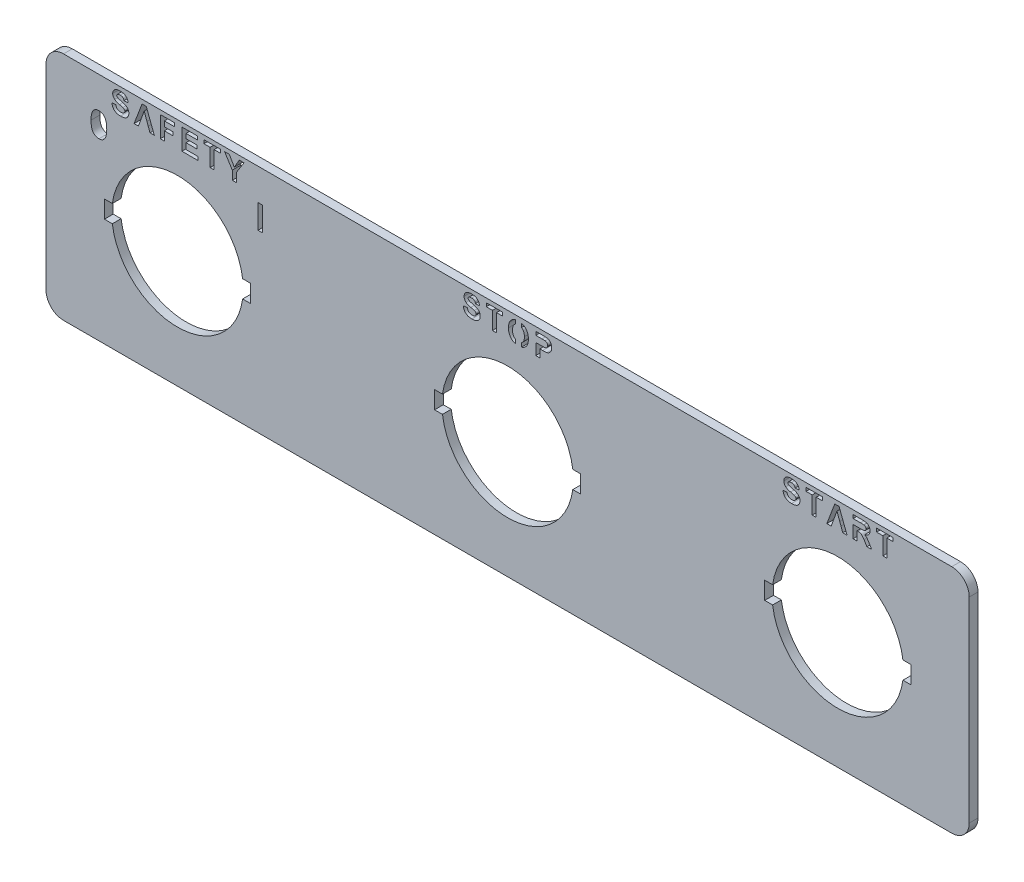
from build123d import *

# Parameters (mm, degrees)
AUFSATZ_LINEAR_AUSTRAGEN1_DEPTH = 1.5
SKIZZE4_W                       = 0.790251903
SKIZZE4_H                       = 4.109309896
SCHNITT_LINEAR_AUSTRAGEN1_DEPTH = 137.976275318
SCHNITT_LINEAR_AUSTRAGEN2_DEPTH = 10
SKIZZE5_W                       = 0.691470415
SKIZZE5_H                       = 1.060254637
SKIZZE5_H_2                     = 0.875862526
AUFSATZ_LINEAR_AUSTRAGEN3_DEPTH = 1.5


with BuildPart() as part:
    # Skizze3 → Aufsatz-Linear austragen1 (new body)
    with BuildSketch(Plane.XY):
        with BuildLine():
            Line((132.5, 19.5), (-19.5, 19.5))
            ThreePointArc((-19.5, 19.5), (-21.621320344, 18.621320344), (-22.5, 16.5))
            Line((-22.5, 16.5), (-22.5, -17))
            ThreePointArc((-22.5, -17), (-21.621320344, -19.121320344), (-19.5, -20))
            Line((-19.5, -20), (132.5, -20))
            ThreePointArc((132.5, -20), (134.621320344, -19.121320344), (135.5, -17))
            Line((135.5, -17), (135.5, 16.5))
            ThreePointArc((135.5, 16.5), (134.621320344, 18.621320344), (132.5, 19.5))
        make_face()
        with BuildLine():
            Line((11.14955156, 1.5), (12.5, 1.5))
            Line((12.5, 1.5), (12.5, -1.5))
            Line((12.5, -1.5), (11.14955156, -1.5))
            ThreePointArc((11.14955156, -1.5), (0, -11.25), (-11.14955156, -1.5))
            Line((-11.14955156, -1.5), (-12.5, -1.5))
            Line((-12.5, -1.5), (-12.5, 1.5))
            Line((-12.5, 1.5), (-11.14955156, 1.5))
            ThreePointArc((-11.14955156, 1.5), (0, 11.25), (11.14955156, 1.5))
        make_face(mode=Mode.SUBTRACT)
        with BuildLine():
            Line((67.64955156, 1.5), (69, 1.5))
            Line((69, 1.5), (69, -1.5))
            Line((69, -1.5), (67.64955156, -1.5))
            ThreePointArc((67.64955156, -1.5), (56.5, -11.25), (45.35044844, -1.5))
            Line((45.35044844, -1.5), (44, -1.5))
            Line((44, -1.5), (44, 1.5))
            Line((44, 1.5), (45.35044844, 1.5))
            ThreePointArc((45.35044844, 1.5), (56.5, 11.25), (67.64955156, 1.5))
        make_face(mode=Mode.SUBTRACT)
        with BuildLine():
            Line((124.14955156, 1.5), (125.5, 1.5))
            Line((125.5, 1.5), (125.5, -1.5))
            Line((125.5, -1.5), (124.14955156, -1.5))
            ThreePointArc((124.14955156, -1.5), (113, -11.25), (101.85044844, -1.5))
            Line((101.85044844, -1.5), (100.5, -1.5))
            Line((100.5, -1.5), (100.5, 1.5))
            Line((100.5, 1.5), (101.85044844, 1.5))
            ThreePointArc((101.85044844, 1.5), (113, 11.25), (124.14955156, 1.5))
        make_face(mode=Mode.SUBTRACT)
    extrude(amount=AUFSATZ_LINEAR_AUSTRAGEN1_DEPTH)

    # Skizze4 → Schnitt-Linear austragen1 (cut, through all)
    # profile 1 of 17: a face of its own
    with BuildSketch(Plane.XY):
        with BuildLine():
            Line((-11.224869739, 16.39854872), (-10.533399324, 16.444646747))
            add(Edge.make_bspline(
                [(-10.533399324, 16.444646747), (-10.527890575, 16.41571806), (-10.517190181, 16.359525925), (-10.493415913, 16.279444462), (-10.467247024, 16.204785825), (-10.435973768, 16.136350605), (-10.40173754, 16.072873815), (-10.361725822, 16.016163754), (-10.318729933, 15.964409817), (-10.270621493, 15.919470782), (-10.218207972, 15.880112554), (-10.161227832, 15.846546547), (-10.100298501, 15.817494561), (-10.035271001, 15.793571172), (-9.965475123, 15.775712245), (-9.891518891, 15.763006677), (-9.81329624, 15.754870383), (-9.759837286, 15.753750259), (-9.732446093, 15.753176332)],
                knots=[0, 0, 0, 0, 1.204560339, 2.339781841, 3.415289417, 4.440034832, 5.416475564, 6.362424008, 7.275913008, 8.16578645, 9.05021719, 9.95355393, 10.867835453, 11.809845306, 12.784702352, 13.812224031, 14.87903166, 16, 16, 16, 16], degree=3))
            add(Edge.make_bspline(
                [(-9.732446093, 15.753176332), (-9.70361513, 15.753490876), (-9.647537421, 15.75410268), (-9.566274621, 15.76169265), (-9.490290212, 15.772566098), (-9.420255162, 15.789778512), (-9.354861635, 15.809027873), (-9.295733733, 15.835363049), (-9.241914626, 15.865736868), (-9.193542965, 15.900203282), (-9.151328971, 15.938429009), (-9.114398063, 15.978335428), (-9.082233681, 16.019060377), (-9.056918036, 16.062411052), (-9.036430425, 16.106634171), (-9.022889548, 16.153048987), (-9.013741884, 16.200589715), (-9.012692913, 16.233080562), (-9.012164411, 16.249450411)],
                knots=[0, 0, 0, 0, 1.417779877, 2.757654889, 4.012140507, 5.189587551, 6.302846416, 7.360586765, 8.365575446, 9.33904572, 10.275781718, 11.161696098, 12.012180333, 12.822428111, 13.625933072, 14.403138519, 15.195454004, 16, 16, 16, 16], degree=3))
            add(Edge.make_bspline(
                [(-9.012164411, 16.249450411), (-9.012812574, 16.269960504), (-9.014080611, 16.310085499), (-9.029346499, 16.367448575), (-9.052240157, 16.420593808), (-9.086710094, 16.468736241), (-9.133046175, 16.512731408), (-9.192152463, 16.553887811), (-9.265678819, 16.590912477), (-9.320225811, 16.611564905), (-9.349256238, 16.622556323)],
                knots=[0, 0, 0, 0, 0.90494901, 1.770400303, 2.607161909, 3.452839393, 4.36912122, 5.420987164, 6.627424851, 8, 8, 8, 8], degree=3))
            add(Edge.make_bspline(
                [(-9.349256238, 16.622556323), (-9.361712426, 16.626730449), (-9.389587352, 16.636071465), (-9.437139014, 16.649428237), (-9.494416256, 16.666107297), (-9.562246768, 16.685065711), (-9.640607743, 16.704455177), (-9.728623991, 16.7283408), (-9.827368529, 16.752108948), (-9.896450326, 16.769654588), (-9.932684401, 16.778857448)],
                knots=[0, 0, 0, 0, 0.521821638, 1.167752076, 1.961721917, 2.891982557, 3.96540661, 5.168436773, 6.514817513, 8, 8, 8, 8], degree=3))
            add(Edge.make_bspline(
                [(-9.932684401, 16.778857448), (-9.979871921, 16.79063907), (-10.070912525, 16.813369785), (-10.200757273, 16.853806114), (-10.320346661, 16.893981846), (-10.428529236, 16.937574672), (-10.526498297, 16.981630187), (-10.612669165, 17.029241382), (-10.688840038, 17.077935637), (-10.733226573, 17.114330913), (-10.754525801, 17.131795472)],
                knots=[0, 0, 0, 0, 1.293880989, 2.496331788, 3.617634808, 4.64976062, 5.598842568, 6.473791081, 7.267636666, 8, 8, 8, 8], degree=3))
            add(Edge.make_bspline(
                [(-10.754525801, 17.131795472), (-10.780939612, 17.15652661), (-10.83272633, 17.205014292), (-10.900895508, 17.284688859), (-10.958176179, 17.368852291), (-11.005324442, 17.456883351), (-11.041627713, 17.549288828), (-11.067359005, 17.645450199), (-11.084013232, 17.745618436), (-11.085712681, 17.813835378), (-11.086575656, 17.848475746)],
                knots=[0, 0, 0, 0, 1.064429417, 2.086912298, 3.078678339, 4.055528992, 5.020032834, 5.993708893, 6.981211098, 8, 8, 8, 8], degree=3))
            add(Edge.make_bspline(
                [(-11.086575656, 17.848475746), (-11.084895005, 17.89329997), (-11.081561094, 17.98221785), (-11.050986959, 18.112914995), (-11.00336081, 18.239027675), (-10.94812577, 18.339165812), (-10.895056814, 18.414920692), (-10.850986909, 18.4692817), (-10.802571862, 18.520158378), (-10.749148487, 18.566309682), (-10.692700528, 18.610438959), (-10.631040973, 18.649626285), (-10.565918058, 18.686538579), (-10.47167778, 18.730296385), (-10.343725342, 18.775896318), (-10.177252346, 18.814334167), (-9.995996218, 18.837440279), (-9.870330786, 18.84027491), (-9.805194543, 18.841744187)],
                knots=[0, 0, 0, 0, 1.180131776, 2.341029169, 3.518901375, 4.725685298, 5.343762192, 5.955650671, 6.568945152, 7.192346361, 7.815201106, 8.455999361, 9.116257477, 9.787318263, 11.192748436, 12.688084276, 14.283332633, 16, 16, 16, 16], degree=3))
            add(Edge.make_bspline(
                [(-9.805194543, 18.841744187), (-9.751860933, 18.841030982), (-9.648128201, 18.839643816), (-9.497755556, 18.825616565), (-9.357299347, 18.803784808), (-9.227252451, 18.772445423), (-9.107554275, 18.731037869), (-8.997740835, 18.681713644), (-8.897905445, 18.623153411), (-8.809263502, 18.555021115), (-8.730292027, 18.479909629), (-8.661402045, 18.397866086), (-8.602330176, 18.309926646), (-8.552695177, 18.216155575), (-8.513716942, 18.116070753), (-8.485088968, 18.009797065), (-8.466154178, 17.897584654), (-8.461408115, 17.820695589), (-8.458988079, 17.78148955)],
                knots=[0, 0, 0, 0, 1.325124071, 2.577337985, 3.749592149, 4.855247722, 5.896868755, 6.892903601, 7.842551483, 8.766257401, 9.665194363, 10.546067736, 11.423174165, 12.293291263, 13.177512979, 14.086532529, 15.024315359, 16, 16, 16, 16], degree=3))
            Line((-8.458988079, 17.78148955), (-9.150458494, 17.735391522))
            add(Edge.make_bspline(
                [(-9.150458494, 17.735391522), (-9.154447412, 17.75707418), (-9.162221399, 17.799331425), (-9.179124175, 17.859852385), (-9.198189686, 17.91582737), (-9.220504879, 17.967256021), (-9.247458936, 18.013217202), (-9.276792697, 18.055156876), (-9.309315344, 18.09251622), (-9.346103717, 18.124272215), (-9.385893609, 18.15316887), (-9.431240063, 18.176330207), (-9.480243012, 18.19781883), (-9.534766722, 18.213973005), (-9.593764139, 18.226787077), (-9.657269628, 18.236286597), (-9.725414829, 18.240924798), (-9.772296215, 18.241943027), (-9.796551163, 18.242469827)],
                knots=[0, 0, 0, 0, 1.151066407, 2.24330871, 3.278475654, 4.238599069, 5.165719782, 6.056502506, 6.909492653, 7.744782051, 8.590364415, 9.471203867, 10.39832458, 11.382154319, 12.435022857, 13.550631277, 14.73277401, 16, 16, 16, 16], degree=3))
            add(Edge.make_bspline(
                [(-9.796551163, 18.242469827), (-9.821769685, 18.242004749), (-9.870833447, 18.24109992), (-9.942332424, 18.235547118), (-10.00940383, 18.225297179), (-10.07237707, 18.211954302), (-10.131168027, 18.19380224), (-10.185652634, 18.171668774), (-10.236080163, 18.14561087), (-10.266828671, 18.125109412), (-10.282021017, 18.114979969)],
                knots=[0, 0, 0, 0, 1.186678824, 2.308736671, 3.37120409, 4.377216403, 5.334874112, 6.262130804, 7.141346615, 8, 8, 8, 8], degree=3))
            add(Edge.make_bspline(
                [(-10.282021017, 18.114979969), (-10.299407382, 18.101142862), (-10.333079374, 18.074344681), (-10.369317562, 18.021132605), (-10.391133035, 17.961031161), (-10.393758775, 17.918529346), (-10.395105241, 17.896734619)],
                knots=[0, 0, 0, 0, 1.037857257, 2.010007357, 2.979541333, 4, 4, 4, 4], degree=3))
            add(Edge.make_bspline(
                [(-10.395105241, 17.896734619), (-10.394004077, 17.876366), (-10.391834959, 17.836243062), (-10.369956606, 17.77924756), (-10.336310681, 17.726437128), (-10.304874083, 17.69774981), (-10.288503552, 17.682810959)],
                knots=[0, 0, 0, 0, 0.98538058, 1.941042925, 2.927803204, 4, 4, 4, 4], degree=3))
            add(Edge.make_bspline(
                [(-10.288503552, 17.682810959), (-10.275511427, 17.673114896), (-10.246479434, 17.651448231), (-10.193298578, 17.623907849), (-10.129107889, 17.594079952), (-10.052443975, 17.564919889), (-9.963816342, 17.535813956), (-9.863219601, 17.505423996), (-9.75059188, 17.474626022), (-9.628804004, 17.444799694), (-9.505155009, 17.415482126), (-9.38716018, 17.383429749), (-9.277441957, 17.352181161), (-9.176509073, 17.31942757), (-9.083841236, 17.287542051), (-8.999888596, 17.254793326), (-8.924074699, 17.222899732), (-8.835667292, 17.179043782), (-8.735466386, 17.119639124), (-8.630444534, 17.033284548), (-8.537566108, 16.936216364), (-8.472850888, 16.844687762), (-8.428394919, 16.765970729), (-8.399769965, 16.703224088), (-8.375007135, 16.63710495), (-8.354850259, 16.567540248), (-8.340241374, 16.494432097), (-8.328151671, 16.418339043), (-8.321974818, 16.338629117), (-8.321125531, 16.284272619), (-8.320693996, 16.256653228)],
                knots=[0, 0, 0, 0, 0.511875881, 1.143829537, 1.88775736, 2.750598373, 3.734912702, 4.837306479, 6.073130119, 7.42648979, 8.801963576, 10.091065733, 11.292408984, 12.408830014, 13.446061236, 14.39066453, 15.257936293, 16.045629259, 17.510392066, 18.929669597, 20.331293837, 21.746891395, 22.460690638, 23.187651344, 23.925159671, 24.69163991, 25.474819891, 26.281170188, 27.126635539, 28, 28, 28, 28], degree=3))
            add(Edge.make_bspline(
                [(-8.320693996, 16.256653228), (-8.321287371, 16.231181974), (-8.322465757, 16.180598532), (-8.330700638, 16.105519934), (-8.343435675, 16.031774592), (-8.362287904, 15.959270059), (-8.38729731, 15.888148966), (-8.415455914, 15.81738484), (-8.450666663, 15.748520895), (-8.490741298, 15.681500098), (-8.534945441, 15.616372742), (-8.585036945, 15.556294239), (-8.638073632, 15.499260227), (-8.697444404, 15.448464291), (-8.759482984, 15.399793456), (-8.82702695, 15.356689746), (-8.898493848, 15.317684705), (-8.974335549, 15.283069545), (-9.054820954, 15.252905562), (-9.13984553, 15.226057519), (-9.230175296, 15.204084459), (-9.325057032, 15.185250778), (-9.424837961, 15.170928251), (-9.529393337, 15.160927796), (-9.638746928, 15.155288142), (-9.713232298, 15.15436977), (-9.751173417, 15.153901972)],
                knots=[0, 0, 0, 0, 0.900570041, 1.788444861, 2.667795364, 3.545012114, 4.433698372, 5.332345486, 6.235991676, 7.164928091, 8.092777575, 9.015680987, 9.928493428, 10.842962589, 11.775229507, 12.714851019, 13.672254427, 14.652424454, 15.660007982, 16.709910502, 17.803296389, 18.945495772, 20.129342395, 21.366102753, 22.658353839, 24, 24, 24, 24], degree=3))
            add(Edge.make_bspline(
                [(-9.751173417, 15.153901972), (-9.80595454, 15.154796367), (-9.912614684, 15.156537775), (-10.067572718, 15.172124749), (-10.212913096, 15.195981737), (-10.348399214, 15.230606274), (-10.474196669, 15.275056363), (-10.590248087, 15.329809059), (-10.695992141, 15.395191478), (-10.792738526, 15.469617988), (-10.879198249, 15.554444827), (-10.956943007, 15.647914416), (-11.024923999, 15.75086843), (-11.083096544, 15.863145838), (-11.132931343, 15.984139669), (-11.174030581, 16.113905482), (-11.204976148, 16.253062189), (-11.218123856, 16.34921448), (-11.224869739, 16.39854872)],
                knots=[0, 0, 0, 0, 1.217954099, 2.371385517, 3.459848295, 4.490682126, 5.476952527, 6.422732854, 7.338496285, 8.236688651, 9.131557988, 10.026443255, 10.935708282, 11.869506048, 12.834296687, 13.842423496, 14.892981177, 16, 16, 16, 16], degree=3))
        make_face()
    # profile 2 of 17: a face of its own
    with BuildSketch(Plane.XY):
        Polygon((-3.969040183, 15.2), (-4.702286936, 15.2), (-5.005525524, 16.029764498), (-6.385585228, 16.029764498), (-6.688823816, 15.2), (-7.426392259, 15.2), (-6.067220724, 18.795646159), (-5.334694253, 18.795646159), align=None)
        Polygon((-5.225211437, 16.629038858), (-5.697716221, 17.919783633), (-6.168780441, 16.629038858), align=None, mode=Mode.SUBTRACT)
    # profile 3 of 17: a face of its own
    with BuildSketch(Plane.XY):
        Polygon((-2.936444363, 15.2), (-2.936444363, 18.795646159), (-0.493248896, 18.795646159), (-0.493248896, 18.196371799), (-2.244973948, 18.196371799), (-2.244973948, 17.320509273), (-0.723739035, 17.320509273), (-0.723739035, 16.721234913), (-2.244973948, 16.721234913), (-2.244973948, 15.2), align=None)
    # profile 4 of 17: a face of its own
    with BuildSketch(Plane.XY):
        Polygon((0.769837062, 15.2), (0.769837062, 18.795646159), (3.443522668, 18.795646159), (3.443522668, 18.196371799), (1.461307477, 18.196371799), (1.461307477, 17.412705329), (3.305228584, 17.412705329), (3.305228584, 16.813430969), (1.461307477, 16.813430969), (1.461307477, 15.79927436), (3.489620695, 15.79927436), (3.489620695, 15.2), align=None)
    # profile 5 of 17: a face of its own
    with BuildSketch(Plane.XY):
        Polygon((5.582471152, 15.2), (5.582471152, 18.196371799), (4.522216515, 18.196371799), (4.522216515, 18.795646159), (7.334196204, 18.795646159), (7.334196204, 18.196371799), (6.273941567, 18.196371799), (6.273941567, 15.2), align=None)
    # profile 6 of 17: a face of its own
    with BuildSketch(Plane.XY):
        Polygon((9.380948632, 15.2), (9.380948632, 16.713311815), (8.067154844, 18.795646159), (8.876031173, 18.795646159), (9.725963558, 17.314026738), (10.577336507, 18.795646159), (11.386212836, 18.795646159), (10.072419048, 16.708269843), (10.072419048, 15.2), align=None)
    # profile 7 of 17: a face of its own
    with BuildSketch(Plane.XY):
        with BuildLine():
            Line((48.912264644, 16.39854872), (49.603735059, 16.444646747))
            add(Edge.make_bspline(
                [(49.603735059, 16.444646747), (49.609243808, 16.41571806), (49.619944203, 16.359525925), (49.643718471, 16.279444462), (49.66988736, 16.204785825), (49.701160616, 16.136350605), (49.735396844, 16.072873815), (49.775408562, 16.016163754), (49.818404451, 15.964409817), (49.866512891, 15.919470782), (49.918926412, 15.880112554), (49.975906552, 15.846546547), (50.036835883, 15.817494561), (50.101863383, 15.793571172), (50.171659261, 15.775712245), (50.245615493, 15.763006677), (50.323838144, 15.754870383), (50.377297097, 15.753750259), (50.40468829, 15.753176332)],
                knots=[0, 0, 0, 0, 1.204560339, 2.339781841, 3.415289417, 4.440034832, 5.416475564, 6.362424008, 7.275913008, 8.16578645, 9.05021719, 9.95355393, 10.867835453, 11.809845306, 12.784702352, 13.812224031, 14.87903166, 16, 16, 16, 16], degree=3))
            add(Edge.make_bspline(
                [(50.40468829, 15.753176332), (50.433519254, 15.753490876), (50.489596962, 15.75410268), (50.570859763, 15.76169265), (50.646844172, 15.772566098), (50.716879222, 15.789778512), (50.782272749, 15.809027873), (50.841400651, 15.835363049), (50.895219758, 15.865736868), (50.943591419, 15.900203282), (50.985805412, 15.938429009), (51.022736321, 15.978335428), (51.054900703, 16.019060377), (51.080216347, 16.062411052), (51.100703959, 16.106634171), (51.114244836, 16.153048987), (51.1233925, 16.200589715), (51.12444147, 16.233080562), (51.124969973, 16.249450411)],
                knots=[0, 0, 0, 0, 1.417779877, 2.757654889, 4.012140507, 5.189587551, 6.302846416, 7.360586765, 8.365575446, 9.33904572, 10.275781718, 11.161696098, 12.012180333, 12.822428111, 13.625933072, 14.403138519, 15.195454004, 16, 16, 16, 16], degree=3))
            add(Edge.make_bspline(
                [(51.124969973, 16.249450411), (51.12432181, 16.269960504), (51.123053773, 16.310085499), (51.107787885, 16.367448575), (51.084894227, 16.420593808), (51.050424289, 16.468736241), (51.004088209, 16.512731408), (50.944981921, 16.553887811), (50.871455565, 16.590912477), (50.816908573, 16.611564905), (50.787878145, 16.622556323)],
                knots=[0, 0, 0, 0, 0.90494901, 1.770400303, 2.607161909, 3.452839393, 4.36912122, 5.420987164, 6.627424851, 8, 8, 8, 8], degree=3))
            add(Edge.make_bspline(
                [(50.787878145, 16.622556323), (50.775421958, 16.626730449), (50.747547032, 16.636071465), (50.699995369, 16.649428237), (50.642718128, 16.666107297), (50.574887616, 16.685065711), (50.496526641, 16.704455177), (50.408510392, 16.7283408), (50.309765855, 16.752108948), (50.240684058, 16.769654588), (50.204449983, 16.778857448)],
                knots=[0, 0, 0, 0, 0.521821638, 1.167752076, 1.961721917, 2.891982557, 3.96540661, 5.168436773, 6.514817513, 8, 8, 8, 8], degree=3))
            add(Edge.make_bspline(
                [(50.204449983, 16.778857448), (50.157262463, 16.79063907), (50.066221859, 16.813369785), (49.936377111, 16.853806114), (49.816787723, 16.893981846), (49.708605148, 16.937574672), (49.610636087, 16.981630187), (49.524465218, 17.029241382), (49.448294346, 17.077935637), (49.40390781, 17.114330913), (49.382608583, 17.131795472)],
                knots=[0, 0, 0, 0, 1.293880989, 2.496331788, 3.617634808, 4.64976062, 5.598842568, 6.473791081, 7.267636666, 8, 8, 8, 8], degree=3))
            add(Edge.make_bspline(
                [(49.382608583, 17.131795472), (49.356194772, 17.15652661), (49.304408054, 17.205014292), (49.236238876, 17.284688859), (49.178958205, 17.368852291), (49.131809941, 17.456883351), (49.09550667, 17.549288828), (49.069775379, 17.645450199), (49.053121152, 17.745618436), (49.051421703, 17.813835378), (49.050558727, 17.848475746)],
                knots=[0, 0, 0, 0, 1.064429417, 2.086912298, 3.078678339, 4.055528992, 5.020032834, 5.993708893, 6.981211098, 8, 8, 8, 8], degree=3))
            add(Edge.make_bspline(
                [(49.050558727, 17.848475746), (49.052239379, 17.89329997), (49.05557329, 17.98221785), (49.086147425, 18.112914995), (49.133773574, 18.239027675), (49.189008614, 18.339165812), (49.24207757, 18.414920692), (49.286147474, 18.4692817), (49.334562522, 18.520158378), (49.387985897, 18.566309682), (49.444433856, 18.610438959), (49.50609341, 18.649626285), (49.571216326, 18.686538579), (49.665456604, 18.730296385), (49.793409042, 18.775896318), (49.959882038, 18.814334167), (50.141138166, 18.837440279), (50.266803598, 18.84027491), (50.33193984, 18.841744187)],
                knots=[0, 0, 0, 0, 1.180131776, 2.341029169, 3.518901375, 4.725685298, 5.343762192, 5.955650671, 6.568945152, 7.192346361, 7.815201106, 8.455999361, 9.116257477, 9.787318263, 11.192748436, 12.688084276, 14.283332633, 16, 16, 16, 16], degree=3))
            add(Edge.make_bspline(
                [(50.33193984, 18.841744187), (50.385273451, 18.841030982), (50.489006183, 18.839643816), (50.639378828, 18.825616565), (50.779835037, 18.803784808), (50.909881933, 18.772445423), (51.029580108, 18.731037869), (51.139393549, 18.681713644), (51.239228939, 18.623153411), (51.327870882, 18.555021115), (51.406842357, 18.479909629), (51.475732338, 18.397866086), (51.534804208, 18.309926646), (51.584439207, 18.216155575), (51.623417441, 18.116070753), (51.652045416, 18.009797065), (51.670980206, 17.897584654), (51.675726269, 17.820695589), (51.678146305, 17.78148955)],
                knots=[0, 0, 0, 0, 1.325124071, 2.577337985, 3.749592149, 4.855247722, 5.896868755, 6.892903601, 7.842551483, 8.766257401, 9.665194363, 10.546067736, 11.423174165, 12.293291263, 13.177512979, 14.086532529, 15.024315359, 16, 16, 16, 16], degree=3))
            Line((51.678146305, 17.78148955), (50.98667589, 17.735391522))
            add(Edge.make_bspline(
                [(50.98667589, 17.735391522), (50.982686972, 17.75707418), (50.974912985, 17.799331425), (50.958010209, 17.859852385), (50.938944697, 17.91582737), (50.916629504, 17.967256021), (50.889675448, 18.013217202), (50.860341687, 18.055156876), (50.82781904, 18.09251622), (50.791030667, 18.124272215), (50.751240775, 18.15316887), (50.705894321, 18.176330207), (50.656891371, 18.19781883), (50.602367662, 18.213973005), (50.543370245, 18.226787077), (50.479864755, 18.236286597), (50.411719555, 18.240924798), (50.364838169, 18.241943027), (50.340583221, 18.242469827)],
                knots=[0, 0, 0, 0, 1.151066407, 2.24330871, 3.278475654, 4.238599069, 5.165719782, 6.056502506, 6.909492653, 7.744782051, 8.590364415, 9.471203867, 10.39832458, 11.382154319, 12.435022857, 13.550631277, 14.73277401, 16, 16, 16, 16], degree=3))
            add(Edge.make_bspline(
                [(50.340583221, 18.242469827), (50.315364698, 18.242004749), (50.266300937, 18.24109992), (50.194801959, 18.235547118), (50.127730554, 18.225297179), (50.064757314, 18.211954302), (50.005966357, 18.19380224), (49.95148175, 18.171668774), (49.901054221, 18.14561087), (49.870305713, 18.125109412), (49.855113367, 18.114979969)],
                knots=[0, 0, 0, 0, 1.186678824, 2.308736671, 3.37120409, 4.377216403, 5.334874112, 6.262130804, 7.141346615, 8, 8, 8, 8], degree=3))
            add(Edge.make_bspline(
                [(49.855113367, 18.114979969), (49.837727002, 18.101142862), (49.80405501, 18.074344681), (49.767816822, 18.021132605), (49.746001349, 17.961031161), (49.743375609, 17.918529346), (49.742029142, 17.896734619)],
                knots=[0, 0, 0, 0, 1.037857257, 2.010007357, 2.979541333, 4, 4, 4, 4], degree=3))
            add(Edge.make_bspline(
                [(49.742029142, 17.896734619), (49.743130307, 17.876366), (49.745299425, 17.836243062), (49.767177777, 17.77924756), (49.800823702, 17.726437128), (49.832260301, 17.69774981), (49.848630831, 17.682810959)],
                knots=[0, 0, 0, 0, 0.98538058, 1.941042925, 2.927803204, 4, 4, 4, 4], degree=3))
            add(Edge.make_bspline(
                [(49.848630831, 17.682810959), (49.861622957, 17.673114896), (49.89065495, 17.651448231), (49.943835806, 17.623907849), (50.008026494, 17.594079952), (50.084690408, 17.564919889), (50.173318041, 17.535813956), (50.273914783, 17.505423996), (50.386542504, 17.474626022), (50.50833038, 17.444799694), (50.631979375, 17.415482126), (50.749974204, 17.383429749), (50.859692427, 17.352181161), (50.960625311, 17.31942757), (51.053293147, 17.287542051), (51.137245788, 17.254793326), (51.213059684, 17.222899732), (51.301467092, 17.179043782), (51.401667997, 17.119639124), (51.506689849, 17.033284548), (51.599568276, 16.936216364), (51.664283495, 16.844687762), (51.708739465, 16.765970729), (51.737364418, 16.703224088), (51.762127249, 16.63710495), (51.782284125, 16.567540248), (51.79689301, 16.494432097), (51.808982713, 16.418339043), (51.815159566, 16.338629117), (51.816008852, 16.284272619), (51.816440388, 16.256653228)],
                knots=[0, 0, 0, 0, 0.511875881, 1.143829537, 1.88775736, 2.750598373, 3.734912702, 4.837306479, 6.073130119, 7.42648979, 8.801963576, 10.091065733, 11.292408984, 12.408830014, 13.446061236, 14.39066453, 15.257936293, 16.045629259, 17.510392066, 18.929669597, 20.331293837, 21.746891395, 22.460690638, 23.187651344, 23.925159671, 24.69163991, 25.474819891, 26.281170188, 27.126635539, 28, 28, 28, 28], degree=3))
            add(Edge.make_bspline(
                [(51.816440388, 16.256653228), (51.815847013, 16.231181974), (51.814668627, 16.180598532), (51.806433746, 16.105519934), (51.793698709, 16.031774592), (51.77484648, 15.959270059), (51.749837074, 15.888148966), (51.721678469, 15.81738484), (51.68646772, 15.748520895), (51.646393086, 15.681500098), (51.602188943, 15.616372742), (51.552097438, 15.556294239), (51.499060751, 15.499260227), (51.439689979, 15.448464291), (51.3776514, 15.399793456), (51.310107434, 15.356689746), (51.238640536, 15.317684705), (51.162798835, 15.283069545), (51.08231343, 15.252905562), (50.997288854, 15.226057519), (50.906959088, 15.204084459), (50.812077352, 15.185250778), (50.712296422, 15.170928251), (50.607741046, 15.160927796), (50.498387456, 15.155288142), (50.423902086, 15.15436977), (50.385960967, 15.153901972)],
                knots=[0, 0, 0, 0, 0.900570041, 1.788444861, 2.667795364, 3.545012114, 4.433698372, 5.332345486, 6.235991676, 7.164928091, 8.092777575, 9.015680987, 9.928493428, 10.842962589, 11.775229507, 12.714851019, 13.672254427, 14.652424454, 15.660007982, 16.709910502, 17.803296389, 18.945495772, 20.129342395, 21.366102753, 22.658353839, 24, 24, 24, 24], degree=3))
            add(Edge.make_bspline(
                [(50.385960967, 15.153901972), (50.331179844, 15.154796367), (50.2245197, 15.156537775), (50.069561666, 15.172124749), (49.924221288, 15.195981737), (49.78873517, 15.230606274), (49.662937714, 15.275056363), (49.546886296, 15.329809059), (49.441142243, 15.395191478), (49.344395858, 15.469617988), (49.257936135, 15.554444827), (49.180191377, 15.647914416), (49.112210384, 15.75086843), (49.05403784, 15.863145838), (49.004203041, 15.984139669), (48.963103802, 16.113905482), (48.932158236, 16.253062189), (48.919010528, 16.34921448), (48.912264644, 16.39854872)],
                knots=[0, 0, 0, 0, 1.217954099, 2.371385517, 3.459848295, 4.490682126, 5.476952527, 6.422732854, 7.338496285, 8.236688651, 9.131557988, 10.026443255, 10.935708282, 11.869506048, 12.834296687, 13.842423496, 14.892981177, 16, 16, 16, 16], degree=3))
        make_face()
    # profile 8 of 17: a face of its own
    with BuildSketch(Plane.XY):
        Polygon((53.909290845, 15.2), (53.909290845, 18.196371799), (52.849036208, 18.196371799), (52.849036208, 18.795646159), (55.661015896, 18.795646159), (55.661015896, 18.196371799), (54.60076126, 18.196371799), (54.60076126, 15.2), align=None)
    # profile 9 of 17: a face of its own
    with BuildSketch(Plane.XY):
        with BuildLine():
            add(Edge.make_bspline(
                [(56.647513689, 16.976214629), (56.647768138, 17.02064814), (56.648267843, 17.107909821), (56.656926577, 17.235925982), (56.668339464, 17.358634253), (56.686925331, 17.475551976), (56.708789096, 17.587226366), (56.736134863, 17.693624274), (56.76907683, 17.794372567), (56.795282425, 17.858699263), (56.808136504, 17.890252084)],
                knots=[0, 0, 0, 0, 1.141009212, 2.240794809, 3.294380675, 4.305229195, 5.280013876, 6.216333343, 7.125095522, 8, 8, 8, 8], degree=3))
            add(Edge.make_bspline(
                [(56.808136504, 17.890252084), (56.829148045, 17.935108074), (56.870923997, 18.024292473), (56.948508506, 18.150317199), (57.036445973, 18.269168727), (57.134012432, 18.380223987), (57.238716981, 18.481811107), (57.351053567, 18.568755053), (57.467031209, 18.64399211), (57.549517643, 18.681831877), (57.590362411, 18.700568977)],
                knots=[0, 0, 0, 0, 1.031372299, 2.050613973, 3.077158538, 4.108712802, 5.127684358, 6.111366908, 7.06480644, 8, 8, 8, 8], degree=3))
            add(Edge.make_bspline(
                [(57.590362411, 18.700568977), (57.618087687, 18.711941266), (57.674127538, 18.734927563), (57.761220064, 18.763615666), (57.851617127, 18.786923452), (57.94466489, 18.807757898), (58.041266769, 18.822123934), (58.140642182, 18.834169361), (58.243334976, 18.840482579), (58.312797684, 18.841319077), (58.348098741, 18.841744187)],
                knots=[0, 0, 0, 0, 0.92659354, 1.872881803, 2.832850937, 3.813025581, 4.820167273, 5.851730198, 6.908245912, 8, 8, 8, 8], degree=3))
            add(Edge.make_bspline(
                [(58.348098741, 18.841744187), (58.411308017, 18.840159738), (58.535009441, 18.837058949), (58.715702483, 18.814662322), (58.886692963, 18.776843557), (59.047402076, 18.722181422), (59.199215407, 18.653852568), (59.340953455, 18.569098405), (59.472825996, 18.468836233), (59.594578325, 18.354440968), (59.704225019, 18.226111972), (59.799718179, 18.08504803), (59.879824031, 17.931910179), (59.945795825, 17.767120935), (59.996490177, 17.590142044), (60.0331168, 17.401472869), (60.054875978, 17.20097444), (60.057447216, 17.063423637), (60.058767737, 16.992781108)],
                knots=[0, 0, 0, 0, 1.064641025, 2.083517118, 3.061799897, 4.009540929, 4.938075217, 5.861300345, 6.78508344, 7.723570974, 8.670267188, 9.622657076, 10.586935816, 11.576069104, 12.607749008, 13.683335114, 14.81022093, 16, 16, 16, 16], degree=3))
            add(Edge.make_bspline(
                [(60.058767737, 16.992781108), (60.057477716, 16.922611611), (60.054966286, 16.78600471), (60.032800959, 16.587079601), (59.997692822, 16.399785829), (59.945771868, 16.224551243), (59.881769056, 16.060038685), (59.800838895, 15.908207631), (59.707345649, 15.767044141), (59.597854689, 15.640097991), (59.478151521, 15.525046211), (59.346446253, 15.425955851), (59.205739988, 15.341086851), (59.054754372, 15.272560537), (58.894473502, 15.21902415), (58.724374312, 15.180914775), (58.544369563, 15.158604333), (58.421150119, 15.155492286), (58.358182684, 15.153901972)],
                knots=[0, 0, 0, 0, 1.18845052, 2.313691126, 3.386664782, 4.412527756, 5.405809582, 6.372003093, 7.321919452, 8.268293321, 9.206237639, 10.129603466, 11.054616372, 11.9847576, 12.932764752, 13.912672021, 14.933336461, 16, 16, 16, 16], degree=3))
            add(Edge.make_bspline(
                [(58.358182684, 15.153901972), (58.294495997, 15.155495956), (58.169842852, 15.158615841), (57.987918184, 15.180858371), (57.81613047, 15.218980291), (57.654602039, 15.272704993), (57.502231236, 15.340190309), (57.360424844, 15.42419207), (57.229104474, 15.523909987), (57.108401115, 15.637607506), (56.998977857, 15.764180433), (56.90561736, 15.904436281), (56.824682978, 16.054784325), (56.76034367, 16.217501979), (56.708708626, 16.390915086), (56.6735147, 16.57602148), (56.651306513, 16.772311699), (56.648801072, 16.907004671), (56.647513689, 16.976214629)],
                knots=[0, 0, 0, 0, 1.080878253, 2.11558926, 3.1052859, 4.062802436, 5.000434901, 5.928596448, 6.853693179, 7.793554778, 8.738606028, 9.68692032, 10.647726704, 11.63151566, 12.651483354, 13.714466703, 14.825613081, 16, 16, 16, 16], degree=3))
        make_face()
        with BuildLine():
            add(Edge.make_bspline(
                [(57.338984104, 16.999983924), (57.339674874, 16.950246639), (57.341012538, 16.853931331), (57.355260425, 16.714131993), (57.376882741, 16.583439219), (57.408681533, 16.46200134), (57.448853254, 16.349730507), (57.49807194, 16.246532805), (57.556134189, 16.152254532), (57.624541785, 16.068886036), (57.69855344, 15.994454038), (57.77844242, 15.930051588), (57.862719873, 15.874620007), (57.952844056, 15.830856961), (58.046939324, 15.796126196), (58.145736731, 15.770374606), (58.249727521, 15.756234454), (58.320687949, 15.754206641), (58.356742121, 15.753176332)],
                knots=[0, 0, 0, 0, 1.313550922, 2.543666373, 3.708465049, 4.810029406, 5.85539231, 6.85404609, 7.825601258, 8.772642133, 9.696587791, 10.59409323, 11.479048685, 12.35559886, 13.234601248, 14.125357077, 15.047515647, 16, 16, 16, 16], degree=3))
            add(Edge.make_bspline(
                [(58.356742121, 15.753176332), (58.39280115, 15.754185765), (58.463771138, 15.756172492), (58.567634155, 15.770601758), (58.666627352, 15.795249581), (58.760348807, 15.829802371), (58.84922569, 15.87426032), (58.933180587, 15.928449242), (59.011729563, 15.993144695), (59.085660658, 16.066495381), (59.152221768, 16.150417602), (59.209789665, 16.244679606), (59.258984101, 16.348503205), (59.299160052, 16.46192724), (59.330176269, 16.585165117), (59.350916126, 16.718282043), (59.365279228, 16.860897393), (59.366611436, 16.959369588), (59.367297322, 17.010067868)],
                knots=[0, 0, 0, 0, 0.949153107, 1.868086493, 2.754172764, 3.630100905, 4.492260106, 5.365378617, 6.254840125, 7.166615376, 8.102436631, 9.067266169, 10.06813181, 11.121736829, 12.23011542, 13.408501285, 14.665770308, 16, 16, 16, 16], degree=3))
            add(Edge.make_bspline(
                [(59.367297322, 17.010067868), (59.366522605, 17.060276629), (59.365022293, 17.157510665), (59.351956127, 17.298325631), (59.33055616, 17.429332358), (59.300807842, 17.55049691), (59.26149357, 17.661838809), (59.214537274, 17.763662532), (59.157760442, 17.855436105), (59.092644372, 17.937112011), (59.020590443, 18.009002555), (58.942822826, 18.071939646), (58.858899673, 18.124307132), (58.769640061, 18.168367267), (58.674114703, 18.20105532), (58.573294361, 18.224897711), (58.466893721, 18.239579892), (58.394003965, 18.241492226), (58.356742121, 18.242469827)],
                knots=[0, 0, 0, 0, 1.332337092, 2.580197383, 3.749299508, 4.852775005, 5.886662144, 6.878700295, 7.822989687, 8.743523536, 9.644687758, 10.519443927, 11.392806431, 12.264866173, 13.155606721, 14.065961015, 15.011303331, 16, 16, 16, 16], degree=3))
            add(Edge.make_bspline(
                [(58.356742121, 18.242469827), (58.319475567, 18.241507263), (58.246576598, 18.239624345), (58.140010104, 18.22469908), (58.038872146, 18.201567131), (57.943360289, 18.167012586), (57.853323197, 18.123375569), (57.769093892, 18.069256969), (57.690008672, 18.006426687), (57.617309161, 17.933446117), (57.551138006, 17.851054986), (57.494333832, 17.758160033), (57.445895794, 17.655775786), (57.406155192, 17.543599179), (57.376695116, 17.421321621), (57.354052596, 17.28976489), (57.341337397, 17.14813273), (57.339785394, 17.050428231), (57.338984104, 16.999983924)],
                knots=[0, 0, 0, 0, 0.981996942, 1.920933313, 2.83127778, 3.712125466, 4.592427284, 5.463259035, 6.34592384, 7.249932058, 8.173122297, 9.125107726, 10.113123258, 11.154048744, 12.256187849, 13.424658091, 14.670364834, 16, 16, 16, 16], degree=3))
        make_face(mode=Mode.SUBTRACT)
    # profile 10 of 17: a face of its own
    with BuildSketch(Plane.XY):
        with BuildLine():
            Line((61.321853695, 15.2), (61.321853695, 18.795646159))
            Line((61.321853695, 18.795646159), (62.472143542, 18.795646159))
            add(Edge.make_bspline(
                [(62.472143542, 18.795646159), (62.52424562, 18.795589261), (62.623897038, 18.795480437), (62.766043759, 18.792456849), (62.894025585, 18.788176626), (63.00765257, 18.78284579), (63.107324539, 18.774891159), (63.192594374, 18.765679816), (63.263999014, 18.755770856), (63.306047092, 18.745516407), (63.324957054, 18.740904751)],
                knots=[0, 0, 0, 0, 1.460485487, 2.793352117, 3.985295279, 5.050041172, 5.981765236, 6.787433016, 7.454681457, 8, 8, 8, 8], degree=3))
            add(Edge.make_bspline(
                [(63.324957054, 18.740904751), (63.350102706, 18.733734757), (63.400010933, 18.719503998), (63.471513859, 18.68916628), (63.540431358, 18.654006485), (63.605897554, 18.612102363), (63.668134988, 18.564197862), (63.727328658, 18.51068365), (63.783794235, 18.451318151), (63.83675059, 18.386218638), (63.885252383, 18.315713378), (63.927170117, 18.23969813), (63.962288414, 18.158503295), (63.99220862, 18.072739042), (64.01428389, 17.98148584), (64.029732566, 17.885377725), (64.040486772, 17.784372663), (64.041248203, 17.715253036), (64.041637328, 17.679929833)],
                knots=[0, 0, 0, 0, 0.907145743, 1.80047177, 2.69161667, 3.591261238, 4.495029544, 5.415863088, 6.359363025, 7.337192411, 8.326890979, 9.326929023, 10.346104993, 11.395420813, 12.477187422, 13.601053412, 14.774031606, 16, 16, 16, 16], degree=3))
            add(Edge.make_bspline(
                [(64.041637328, 17.679929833), (64.040527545, 17.626287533), (64.038391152, 17.52302316), (64.014488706, 17.374981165), (63.978031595, 17.239754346), (63.924746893, 17.118645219), (63.859781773, 17.011178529), (63.788221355, 16.914297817), (63.706509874, 16.830923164), (63.618227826, 16.759709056), (63.524929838, 16.701430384), (63.43146296, 16.651748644), (63.336565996, 16.613551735), (63.271865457, 16.596909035), (63.239963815, 16.588703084)],
                knots=[0, 0, 0, 0, 1.312386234, 2.526415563, 3.661883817, 4.733421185, 5.753802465, 6.732107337, 7.675884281, 8.604170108, 9.50284679, 10.365392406, 11.194030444, 12, 12, 12, 12], degree=3))
            add(Edge.make_bspline(
                [(63.239963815, 16.588703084), (63.217193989, 16.584371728), (63.16919791, 16.575241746), (63.093079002, 16.566140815), (63.009876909, 16.556067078), (62.919249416, 16.54949642), (62.82130616, 16.543343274), (62.716085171, 16.540438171), (62.603736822, 16.536938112), (62.52640823, 16.53687522), (62.486549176, 16.536842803)],
                knots=[0, 0, 0, 0, 0.735353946, 1.55003838, 2.431865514, 3.394945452, 4.432993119, 5.54609699, 6.735134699, 8, 8, 8, 8], degree=3))
            Line((62.486549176, 16.536842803), (62.01332411, 16.536842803))
            Line((62.01332411, 16.536842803), (62.01332411, 15.2))
            Line((62.01332411, 15.2), (61.321853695, 15.2))
        make_face()
        with BuildLine():
            Line((62.01332411, 18.196371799), (62.01332411, 17.136117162))
            Line((62.01332411, 17.136117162), (62.428206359, 17.136117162))
            add(Edge.make_bspline(
                [(62.428206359, 17.136117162), (62.463983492, 17.136163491), (62.532429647, 17.136252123), (62.630634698, 17.139433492), (62.719530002, 17.143316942), (62.799301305, 17.149744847), (62.869467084, 17.158216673), (62.930497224, 17.168350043), (62.982462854, 17.179224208), (63.038656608, 17.197244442), (63.098738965, 17.226399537), (63.162899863, 17.268302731), (63.219265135, 17.318402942), (63.266168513, 17.377243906), (63.303633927, 17.442619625), (63.330459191, 17.513860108), (63.347780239, 17.589784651), (63.349362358, 17.642379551), (63.350166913, 17.669125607)],
                knots=[0, 0, 0, 0, 1.411705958, 2.700771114, 3.876961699, 4.922619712, 5.858038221, 6.66485904, 7.363650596, 7.950905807, 8.989198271, 9.987739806, 10.967313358, 11.951275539, 12.944273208, 13.927870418, 14.946261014, 16, 16, 16, 16], degree=3))
            add(Edge.make_bspline(
                [(63.350166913, 17.669125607), (63.349034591, 17.701701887), (63.346839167, 17.764862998), (63.322629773, 17.854814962), (63.285277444, 17.936447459), (63.231874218, 18.007220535), (63.167364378, 18.066734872), (63.09485801, 18.116252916), (63.012806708, 18.15090602), (62.954736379, 18.164332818), (62.92520072, 18.17116194)],
                knots=[0, 0, 0, 0, 1.085904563, 2.105425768, 3.088705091, 4.068969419, 5.045188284, 6.010769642, 6.988240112, 8, 8, 8, 8], degree=3))
            add(Edge.make_bspline(
                [(62.92520072, 18.17116194), (62.912490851, 18.17319478), (62.884278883, 18.177707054), (62.83738485, 18.182416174), (62.781909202, 18.186699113), (62.717785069, 18.190215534), (62.645266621, 18.192964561), (62.564114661, 18.195373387), (62.474542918, 18.195566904), (62.411879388, 18.196096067), (62.379227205, 18.196371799)],
                knots=[0, 0, 0, 0, 0.564603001, 1.253243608, 2.066786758, 3.005752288, 4.070476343, 5.250658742, 6.567396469, 8, 8, 8, 8], degree=3))
            Line((62.379227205, 18.196371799), (62.01332411, 18.196371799))
        make_face(mode=Mode.SUBTRACT)
    # profile 11 of 17: a face of its own
    with BuildSketch(Plane.XY):
        with BuildLine():
            Line((103.628270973, 16.39854872), (104.319741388, 16.444646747))
            add(Edge.make_bspline(
                [(104.319741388, 16.444646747), (104.325250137, 16.41571806), (104.335950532, 16.359525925), (104.3597248, 16.279444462), (104.385893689, 16.204785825), (104.417166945, 16.136350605), (104.451403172, 16.072873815), (104.49141489, 16.016163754), (104.53441078, 15.964409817), (104.58251922, 15.919470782), (104.634932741, 15.880112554), (104.691912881, 15.846546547), (104.752842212, 15.817494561), (104.817869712, 15.793571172), (104.88766559, 15.775712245), (104.961621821, 15.763006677), (105.039844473, 15.754870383), (105.093303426, 15.753750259), (105.120694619, 15.753176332)],
                knots=[0, 0, 0, 0, 1.204560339, 2.339781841, 3.415289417, 4.440034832, 5.416475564, 6.362424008, 7.275913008, 8.16578645, 9.05021719, 9.95355393, 10.867835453, 11.809845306, 12.784702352, 13.812224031, 14.87903166, 16, 16, 16, 16], degree=3))
            add(Edge.make_bspline(
                [(105.120694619, 15.753176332), (105.149525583, 15.753490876), (105.205603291, 15.75410268), (105.286866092, 15.76169265), (105.362850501, 15.772566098), (105.432885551, 15.789778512), (105.498279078, 15.809027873), (105.55740698, 15.835363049), (105.611226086, 15.865736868), (105.659597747, 15.900203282), (105.701811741, 15.938429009), (105.73874265, 15.978335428), (105.770907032, 16.019060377), (105.796222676, 16.062411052), (105.816710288, 16.106634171), (105.830251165, 16.153048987), (105.839398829, 16.200589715), (105.840447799, 16.233080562), (105.840976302, 16.249450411)],
                knots=[0, 0, 0, 0, 1.417779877, 2.757654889, 4.012140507, 5.189587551, 6.302846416, 7.360586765, 8.365575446, 9.33904572, 10.275781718, 11.161696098, 12.012180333, 12.822428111, 13.625933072, 14.403138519, 15.195454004, 16, 16, 16, 16], degree=3))
            add(Edge.make_bspline(
                [(105.840976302, 16.249450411), (105.840328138, 16.269960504), (105.839060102, 16.310085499), (105.823794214, 16.367448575), (105.800900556, 16.420593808), (105.766430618, 16.468736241), (105.720094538, 16.512731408), (105.66098825, 16.553887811), (105.587461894, 16.590912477), (105.532914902, 16.611564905), (105.503884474, 16.622556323)],
                knots=[0, 0, 0, 0, 0.90494901, 1.770400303, 2.607161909, 3.452839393, 4.36912122, 5.420987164, 6.627424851, 8, 8, 8, 8], degree=3))
            add(Edge.make_bspline(
                [(105.503884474, 16.622556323), (105.491428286, 16.626730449), (105.463553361, 16.636071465), (105.416001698, 16.649428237), (105.358724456, 16.666107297), (105.290893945, 16.685065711), (105.21253297, 16.704455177), (105.124516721, 16.7283408), (105.025772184, 16.752108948), (104.956690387, 16.769654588), (104.920456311, 16.778857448)],
                knots=[0, 0, 0, 0, 0.521821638, 1.167752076, 1.961721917, 2.891982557, 3.96540661, 5.168436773, 6.514817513, 8, 8, 8, 8], degree=3))
            add(Edge.make_bspline(
                [(104.920456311, 16.778857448), (104.873268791, 16.79063907), (104.782228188, 16.813369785), (104.65238344, 16.853806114), (104.532794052, 16.893981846), (104.424611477, 16.937574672), (104.326642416, 16.981630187), (104.240471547, 17.029241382), (104.164300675, 17.077935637), (104.119914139, 17.114330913), (104.098614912, 17.131795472)],
                knots=[0, 0, 0, 0, 1.293880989, 2.496331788, 3.617634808, 4.64976062, 5.598842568, 6.473791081, 7.267636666, 8, 8, 8, 8], degree=3))
            add(Edge.make_bspline(
                [(104.098614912, 17.131795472), (104.072201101, 17.15652661), (104.020414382, 17.205014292), (103.952245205, 17.284688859), (103.894964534, 17.368852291), (103.84781627, 17.456883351), (103.811512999, 17.549288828), (103.785781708, 17.645450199), (103.769127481, 17.745618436), (103.767428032, 17.813835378), (103.766565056, 17.848475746)],
                knots=[0, 0, 0, 0, 1.064429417, 2.086912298, 3.078678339, 4.055528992, 5.020032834, 5.993708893, 6.981211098, 8, 8, 8, 8], degree=3))
            add(Edge.make_bspline(
                [(103.766565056, 17.848475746), (103.768245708, 17.89329997), (103.771579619, 17.98221785), (103.802153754, 18.112914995), (103.849779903, 18.239027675), (103.905014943, 18.339165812), (103.958083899, 18.414920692), (104.002153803, 18.4692817), (104.050568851, 18.520158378), (104.103992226, 18.566309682), (104.160440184, 18.610438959), (104.222099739, 18.649626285), (104.287222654, 18.686538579), (104.381462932, 18.730296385), (104.509415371, 18.775896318), (104.675888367, 18.814334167), (104.857144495, 18.837440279), (104.982809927, 18.84027491), (105.047946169, 18.841744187)],
                knots=[0, 0, 0, 0, 1.180131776, 2.341029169, 3.518901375, 4.725685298, 5.343762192, 5.955650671, 6.568945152, 7.192346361, 7.815201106, 8.455999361, 9.116257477, 9.787318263, 11.192748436, 12.688084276, 14.283332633, 16, 16, 16, 16], degree=3))
            add(Edge.make_bspline(
                [(105.047946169, 18.841744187), (105.10127978, 18.841030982), (105.205012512, 18.839643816), (105.355385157, 18.825616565), (105.495841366, 18.803784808), (105.625888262, 18.772445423), (105.745586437, 18.731037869), (105.855399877, 18.681713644), (105.955235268, 18.623153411), (106.043877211, 18.555021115), (106.122848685, 18.479909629), (106.191738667, 18.397866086), (106.250810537, 18.309926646), (106.300445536, 18.216155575), (106.33942377, 18.116070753), (106.368051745, 18.009797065), (106.386986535, 17.897584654), (106.391732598, 17.820695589), (106.394152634, 17.78148955)],
                knots=[0, 0, 0, 0, 1.325124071, 2.577337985, 3.749592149, 4.855247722, 5.896868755, 6.892903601, 7.842551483, 8.766257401, 9.665194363, 10.546067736, 11.423174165, 12.293291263, 13.177512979, 14.086532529, 15.024315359, 16, 16, 16, 16], degree=3))
            Line((106.394152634, 17.78148955), (105.702682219, 17.735391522))
            add(Edge.make_bspline(
                [(105.702682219, 17.735391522), (105.6986933, 17.75707418), (105.690919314, 17.799331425), (105.674016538, 17.859852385), (105.654951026, 17.91582737), (105.632635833, 17.967256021), (105.605681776, 18.013217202), (105.576348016, 18.055156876), (105.543825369, 18.09251622), (105.507036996, 18.124272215), (105.467247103, 18.15316887), (105.42190065, 18.176330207), (105.3728977, 18.19781883), (105.318373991, 18.213973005), (105.259376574, 18.226787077), (105.195871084, 18.236286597), (105.127725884, 18.240924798), (105.080844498, 18.241943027), (105.056589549, 18.242469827)],
                knots=[0, 0, 0, 0, 1.151066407, 2.24330871, 3.278475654, 4.238599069, 5.165719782, 6.056502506, 6.909492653, 7.744782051, 8.590364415, 9.471203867, 10.39832458, 11.382154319, 12.435022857, 13.550631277, 14.73277401, 16, 16, 16, 16], degree=3))
            add(Edge.make_bspline(
                [(105.056589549, 18.242469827), (105.031371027, 18.242004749), (104.982307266, 18.24109992), (104.910808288, 18.235547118), (104.843736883, 18.225297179), (104.780763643, 18.211954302), (104.721972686, 18.19380224), (104.667488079, 18.171668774), (104.61706055, 18.14561087), (104.586312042, 18.125109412), (104.571119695, 18.114979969)],
                knots=[0, 0, 0, 0, 1.186678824, 2.308736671, 3.37120409, 4.377216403, 5.334874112, 6.262130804, 7.141346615, 8, 8, 8, 8], degree=3))
            add(Edge.make_bspline(
                [(104.571119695, 18.114979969), (104.553733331, 18.101142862), (104.520061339, 18.074344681), (104.483823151, 18.021132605), (104.462007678, 17.961031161), (104.459381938, 17.918529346), (104.458035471, 17.896734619)],
                knots=[0, 0, 0, 0, 1.037857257, 2.010007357, 2.979541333, 4, 4, 4, 4], degree=3))
            add(Edge.make_bspline(
                [(104.458035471, 17.896734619), (104.459136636, 17.876366), (104.461305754, 17.836243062), (104.483184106, 17.77924756), (104.516830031, 17.726437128), (104.54826663, 17.69774981), (104.56463716, 17.682810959)],
                knots=[0, 0, 0, 0, 0.98538058, 1.941042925, 2.927803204, 4, 4, 4, 4], degree=3))
            add(Edge.make_bspline(
                [(104.56463716, 17.682810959), (104.577629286, 17.673114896), (104.606661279, 17.651448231), (104.659842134, 17.623907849), (104.724032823, 17.594079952), (104.800696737, 17.564919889), (104.88932437, 17.535813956), (104.989921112, 17.505423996), (105.102548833, 17.474626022), (105.224336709, 17.444799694), (105.347985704, 17.415482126), (105.465980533, 17.383429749), (105.575698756, 17.352181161), (105.67663164, 17.31942757), (105.769299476, 17.287542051), (105.853252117, 17.254793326), (105.929066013, 17.222899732), (106.017473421, 17.179043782), (106.117674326, 17.119639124), (106.222696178, 17.033284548), (106.315574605, 16.936216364), (106.380289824, 16.844687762), (106.424745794, 16.765970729), (106.453370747, 16.703224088), (106.478133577, 16.63710495), (106.498290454, 16.567540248), (106.512899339, 16.494432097), (106.524989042, 16.418339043), (106.531165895, 16.338629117), (106.532015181, 16.284272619), (106.532446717, 16.256653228)],
                knots=[0, 0, 0, 0, 0.511875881, 1.143829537, 1.88775736, 2.750598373, 3.734912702, 4.837306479, 6.073130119, 7.42648979, 8.801963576, 10.091065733, 11.292408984, 12.408830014, 13.446061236, 14.39066453, 15.257936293, 16.045629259, 17.510392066, 18.929669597, 20.331293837, 21.746891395, 22.460690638, 23.187651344, 23.925159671, 24.69163991, 25.474819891, 26.281170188, 27.126635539, 28, 28, 28, 28], degree=3))
            add(Edge.make_bspline(
                [(106.532446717, 16.256653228), (106.531853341, 16.231181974), (106.530674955, 16.180598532), (106.522440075, 16.105519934), (106.509705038, 16.031774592), (106.490852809, 15.959270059), (106.465843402, 15.888148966), (106.437684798, 15.81738484), (106.402474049, 15.748520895), (106.362399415, 15.681500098), (106.318195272, 15.616372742), (106.268103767, 15.556294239), (106.21506708, 15.499260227), (106.155696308, 15.448464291), (106.093657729, 15.399793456), (106.026113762, 15.356689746), (105.954646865, 15.317684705), (105.878805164, 15.283069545), (105.798319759, 15.252905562), (105.713295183, 15.226057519), (105.622965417, 15.204084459), (105.528083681, 15.185250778), (105.428302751, 15.170928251), (105.323747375, 15.160927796), (105.214393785, 15.155288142), (105.139908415, 15.15436977), (105.101967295, 15.153901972)],
                knots=[0, 0, 0, 0, 0.900570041, 1.788444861, 2.667795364, 3.545012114, 4.433698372, 5.332345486, 6.235991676, 7.164928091, 8.092777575, 9.015680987, 9.928493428, 10.842962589, 11.775229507, 12.714851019, 13.672254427, 14.652424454, 15.660007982, 16.709910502, 17.803296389, 18.945495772, 20.129342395, 21.366102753, 22.658353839, 24, 24, 24, 24], degree=3))
            add(Edge.make_bspline(
                [(105.101967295, 15.153901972), (105.047186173, 15.154796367), (104.940526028, 15.156537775), (104.785567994, 15.172124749), (104.640227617, 15.195981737), (104.504741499, 15.230606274), (104.378944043, 15.275056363), (104.262892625, 15.329809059), (104.157148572, 15.395191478), (104.060402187, 15.469617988), (103.973942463, 15.554444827), (103.896197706, 15.647914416), (103.828216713, 15.75086843), (103.770044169, 15.863145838), (103.72020937, 15.984139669), (103.679110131, 16.113905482), (103.648164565, 16.253062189), (103.635016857, 16.34921448), (103.628270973, 16.39854872)],
                knots=[0, 0, 0, 0, 1.217954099, 2.371385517, 3.459848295, 4.490682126, 5.476952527, 6.422732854, 7.338496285, 8.236688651, 9.131557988, 10.026443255, 10.935708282, 11.869506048, 12.834296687, 13.842423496, 14.892981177, 16, 16, 16, 16], degree=3))
        make_face()
    # profile 12 of 17: a face of its own
    with BuildSketch(Plane.XY):
        Polygon((108.625297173, 15.2), (108.625297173, 18.196371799), (107.565042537, 18.196371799), (107.565042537, 18.795646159), (110.377022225, 18.795646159), (110.377022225, 18.196371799), (109.316767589, 18.196371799), (109.316767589, 15.2), align=None)
    # profile 13 of 17: a face of its own
    with BuildSketch(Plane.XY):
        Polygon((114.590381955, 15.2), (113.857135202, 15.2), (113.553896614, 16.029764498), (112.17383691, 16.029764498), (111.870598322, 15.2), (111.133029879, 15.2), (112.492201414, 18.795646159), (113.224727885, 18.795646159), align=None)
        Polygon((113.334210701, 16.629038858), (112.861705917, 17.919783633), (112.390641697, 16.629038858), align=None, mode=Mode.SUBTRACT)
    # profile 14 of 17: a face of its own
    with BuildSketch(Plane.XY):
        with BuildLine():
            Line((115.622977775, 15.2), (115.622977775, 18.795646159))
            Line((115.622977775, 18.795646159), (117.1319679, 18.795646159))
            add(Edge.make_bspline(
                [(117.1319679, 18.795646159), (117.177827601, 18.795363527), (117.266207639, 18.794818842), (117.394022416, 18.790846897), (117.511896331, 18.782525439), (117.620352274, 18.77310132), (117.718869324, 18.759389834), (117.807836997, 18.742963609), (117.887105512, 18.723927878), (117.957831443, 18.701129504), (118.022319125, 18.675035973), (118.082392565, 18.64397733), (118.138712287, 18.607588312), (118.192143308, 18.567123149), (118.242911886, 18.522519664), (118.289626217, 18.472597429), (118.333100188, 18.418099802), (118.373298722, 18.359480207), (118.408711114, 18.296997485), (118.441068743, 18.232658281), (118.467409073, 18.165777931), (118.489165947, 18.09667149), (118.506545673, 18.025488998), (118.518608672, 17.952049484), (118.526139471, 17.876485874), (118.526811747, 17.825444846), (118.527153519, 17.799496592)],
                knots=[0, 0, 0, 0, 1.675828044, 3.229627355, 4.67171229, 5.993455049, 7.206927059, 8.304770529, 9.29850117, 10.183580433, 11.017754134, 11.837875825, 12.650738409, 13.464925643, 14.285328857, 15.117007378, 15.959673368, 16.830859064, 17.711229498, 18.58228265, 19.460420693, 20.334473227, 21.228207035, 22.135446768, 23.052097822, 24, 24, 24, 24], degree=3))
            add(Edge.make_bspline(
                [(118.527153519, 17.799496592), (118.526519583, 17.766809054), (118.525280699, 17.702928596), (118.513879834, 17.609299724), (118.496946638, 17.519844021), (118.472808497, 17.434437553), (118.439619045, 17.354084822), (118.401090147, 17.277660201), (118.355137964, 17.205422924), (118.302074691, 17.138089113), (118.241947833, 17.075599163), (118.174493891, 17.019239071), (118.100194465, 16.968788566), (118.018600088, 16.924538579), (117.930278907, 16.886709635), (117.834847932, 16.854881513), (117.732739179, 16.828976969), (117.661712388, 16.816788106), (117.625360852, 16.810549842)],
                knots=[0, 0, 0, 0, 1.05911256, 2.069797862, 3.05271628, 4.008392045, 4.940519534, 5.866323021, 6.779546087, 7.71056835, 8.640711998, 9.585328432, 10.554502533, 11.547017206, 12.589327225, 13.664782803, 14.804835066, 16, 16, 16, 16], degree=3))
            add(Edge.make_bspline(
                [(117.625360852, 16.810549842), (117.660516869, 16.787265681), (117.729321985, 16.741695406), (117.824518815, 16.666640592), (117.909982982, 16.587864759), (117.974692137, 16.517812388), (118.024414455, 16.456208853), (118.064449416, 16.402329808), (118.107633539, 16.340322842), (118.153543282, 16.270154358), (118.203535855, 16.192445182), (118.255751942, 16.106005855), (118.311284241, 16.011679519), (118.348620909, 15.945787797), (118.367971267, 15.911638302)],
                knots=[0, 0, 0, 0, 1.285445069, 2.515791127, 3.691898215, 4.826622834, 5.420063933, 6.105349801, 6.873086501, 7.723915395, 8.66222816, 9.690593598, 10.803111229, 12, 12, 12, 12], degree=3))
            Line((118.367971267, 15.911638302), (118.803741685, 15.2))
            Line((118.803741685, 15.2), (117.995585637, 15.2))
            Line((117.995585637, 15.2), (117.484185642, 16.016079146))
            add(Edge.make_bspline(
                [(117.484185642, 16.016079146), (117.460699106, 16.048762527), (117.415858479, 16.11116182), (117.351128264, 16.199833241), (117.291905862, 16.278766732), (117.239767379, 16.349105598), (117.19207463, 16.408855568), (117.150275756, 16.459057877), (117.115222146, 16.500789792), (117.0755589, 16.542168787), (117.029414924, 16.584694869), (116.972292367, 16.625926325), (116.913632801, 16.658795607), (116.850783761, 16.683875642), (116.778100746, 16.701363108), (116.690724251, 16.712504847), (116.585906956, 16.720725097), (116.510145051, 16.72105636), (116.469308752, 16.721234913)],
                knots=[0, 0, 0, 0, 1.465447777, 2.797841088, 3.997266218, 5.05856206, 5.985598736, 6.780315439, 7.437430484, 7.969193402, 8.866571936, 9.718200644, 10.52825214, 11.309096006, 12.174169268, 13.242355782, 14.513606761, 16, 16, 16, 16], degree=3))
            Line((116.469308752, 16.721234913), (116.31444819, 16.721234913))
            Line((116.31444819, 16.721234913), (116.31444819, 15.2))
            Line((116.31444819, 15.2), (115.622977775, 15.2))
        make_face()
        with BuildLine():
            Line((116.31444819, 17.320509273), (116.871225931, 17.320509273))
            add(Edge.make_bspline(
                [(116.871225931, 17.320509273), (116.914204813, 17.32060138), (116.996086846, 17.320776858), (117.112524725, 17.323318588), (117.216542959, 17.325475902), (117.307519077, 17.330896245), (117.385860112, 17.336268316), (117.4512518, 17.343250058), (117.504245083, 17.351502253), (117.557176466, 17.364332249), (117.611396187, 17.386685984), (117.669184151, 17.418524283), (117.718574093, 17.45982719), (117.761357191, 17.507577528), (117.793994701, 17.563712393), (117.819557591, 17.625730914), (117.832518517, 17.695011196), (117.834606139, 17.743031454), (117.835683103, 17.767804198)],
                knots=[0, 0, 0, 0, 1.697953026, 3.23488743, 4.60134403, 5.807846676, 6.835100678, 7.703488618, 8.405232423, 8.952775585, 9.851109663, 10.713519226, 11.549115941, 12.382556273, 13.233359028, 14.101746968, 15.020727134, 16, 16, 16, 16], degree=3))
            add(Edge.make_bspline(
                [(117.835683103, 17.767804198), (117.834458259, 17.795517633), (117.832095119, 17.848986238), (117.813459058, 17.925072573), (117.780930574, 17.992284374), (117.736256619, 18.050732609), (117.680175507, 18.100087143), (117.6133767, 18.139263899), (117.536356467, 18.168441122), (117.480804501, 18.179216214), (117.451772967, 18.184847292)],
                knots=[0, 0, 0, 0, 1.062977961, 2.050844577, 2.982300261, 3.90936959, 4.856017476, 5.831122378, 6.86654153, 8, 8, 8, 8], degree=3))
            add(Edge.make_bspline(
                [(117.451772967, 18.184847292), (117.442176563, 18.185901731), (117.419431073, 18.188400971), (117.379265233, 18.190006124), (117.327908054, 18.192473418), (117.264737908, 18.193481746), (117.190319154, 18.195249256), (117.10435587, 18.195573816), (117.007121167, 18.196610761), (116.938452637, 18.196454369), (116.902198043, 18.196371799)],
                knots=[0, 0, 0, 0, 0.42127143, 0.998501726, 1.753681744, 2.66564073, 3.755712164, 5.002818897, 6.417592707, 8, 8, 8, 8], degree=3))
            Line((116.902198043, 18.196371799), (116.31444819, 18.196371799))
            Line((116.31444819, 18.196371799), (116.31444819, 17.320509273))
        make_face(mode=Mode.SUBTRACT)
    # profile 15 of 17: a face of its own
    with BuildSketch(Plane.XY):
        Polygon((120.71220003, 15.2), (120.71220003, 18.196371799), (119.651945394, 18.196371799), (119.651945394, 18.795646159), (122.463925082, 18.795646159), (122.463925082, 18.196371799), (121.403670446, 18.196371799), (121.403670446, 15.2), align=None)
    # profile 16 of 17: a face of its own
    with BuildSketch(Plane.XY):
        with BuildLine():
            add(Edge.make_bspline(
                [(-13.445837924, 14.109309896), (-13.396923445, 14.10813011), (-13.301692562, 14.105833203), (-13.162930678, 14.085486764), (-13.032279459, 14.052862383), (-12.909748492, 14.006745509), (-12.795452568, 13.946860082), (-12.690153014, 13.872950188), (-12.59154889, 13.787231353), (-12.534608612, 13.720712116), (-12.505767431, 13.687019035)],
                knots=[0, 0, 0, 0, 1.098584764, 2.138818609, 3.143716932, 4.11936356, 5.073598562, 6.034819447, 7.004603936, 8, 8, 8, 8], degree=3))
            add(Edge.make_bspline(
                [(-12.505767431, 13.687019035), (-12.489269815, 13.665560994), (-12.455601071, 13.621768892), (-12.410256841, 13.551005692), (-12.366664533, 13.475941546), (-12.328612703, 13.394769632), (-12.292176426, 13.308898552), (-12.258410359, 13.218132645), (-12.229092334, 13.121721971), (-12.201505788, 13.020899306), (-12.179025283, 12.914090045), (-12.158251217, 12.802447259), (-12.141028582, 12.685464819), (-12.127447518, 12.563517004), (-12.115318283, 12.436789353), (-12.108672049, 12.304677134), (-12.1032302, 12.167475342), (-12.102686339, 12.074143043), (-12.102409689, 12.02666686)],
                knots=[0, 0, 0, 0, 0.746761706, 1.524009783, 2.317797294, 3.140957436, 3.996208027, 4.892396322, 5.812273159, 6.776774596, 7.776522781, 8.823794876, 9.910947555, 11.039215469, 12.21036455, 13.424061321, 14.689674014, 16, 16, 16, 16], degree=3))
            add(Edge.make_bspline(
                [(-12.102409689, 12.02666686), (-12.102682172, 11.979190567), (-12.103216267, 11.886132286), (-12.108692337, 11.749205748), (-12.115324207, 11.617368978), (-12.127419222, 11.490634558), (-12.141130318, 11.368710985), (-12.157860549, 11.251859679), (-12.180197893, 11.140729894), (-12.202324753, 11.034090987), (-12.229749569, 10.932839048), (-12.260385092, 10.836601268), (-12.292794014, 10.744703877), (-12.330077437, 10.658722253), (-12.369494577, 10.577449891), (-12.412438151, 10.501619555), (-12.458288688, 10.430417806), (-12.492283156, 10.386394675), (-12.509060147, 10.364668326)],
                knots=[0, 0, 0, 0, 1.308387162, 2.564569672, 3.776470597, 4.945886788, 6.07248526, 7.158029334, 8.197718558, 9.195987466, 10.159061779, 11.087054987, 11.979325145, 12.84323098, 13.668471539, 14.467659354, 15.243757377, 16, 16, 16, 16], degree=3))
            add(Edge.make_bspline(
                [(-12.509060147, 10.364668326), (-12.53763745, 10.331264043), (-12.594050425, 10.265322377), (-12.691563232, 10.180314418), (-12.796688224, 10.107933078), (-12.910782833, 10.049237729), (-13.032715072, 10.002802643), (-13.163580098, 9.971219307), (-13.301962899, 9.950831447), (-13.397195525, 9.948504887), (-13.445837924, 9.94731654)],
                knots=[0, 0, 0, 0, 0.991631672, 1.957528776, 2.911425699, 3.867574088, 4.848108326, 5.850523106, 6.902101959, 8, 8, 8, 8], degree=3))
            add(Edge.make_bspline(
                [(-13.445837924, 9.94731654), (-13.495036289, 9.948732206), (-13.591443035, 9.951506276), (-13.732201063, 9.973497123), (-13.86599803, 10.008726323), (-13.992353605, 10.059024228), (-14.111086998, 10.124206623), (-14.2231258, 10.202342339), (-14.326032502, 10.296969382), (-14.406597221, 10.38506194), (-14.465538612, 10.464660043), (-14.507109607, 10.530665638), (-14.547283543, 10.60129426), (-14.581958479, 10.678754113), (-14.616168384, 10.760754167), (-14.64646761, 10.849061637), (-14.673199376, 10.942917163), (-14.698298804, 11.041892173), (-14.719228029, 11.146668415), (-14.738479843, 11.256936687), (-14.753651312, 11.373165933), (-14.767102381, 11.494708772), (-14.776572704, 11.621852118), (-14.784263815, 11.754387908), (-14.788120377, 11.892740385), (-14.788879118, 11.986878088), (-14.789266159, 12.03489865)],
                knots=[0, 0, 0, 0, 1.257818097, 2.464759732, 3.634271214, 4.790227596, 5.933394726, 7.09190477, 8.274482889, 9.50191983, 10.139172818, 10.805000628, 11.49619854, 12.215266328, 12.973768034, 13.768328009, 14.601232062, 15.469317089, 16.379095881, 17.333267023, 18.331755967, 19.376479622, 20.460535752, 21.592206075, 22.771760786, 24, 24, 24, 24], degree=3))
            add(Edge.make_bspline(
                [(-14.789266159, 12.03489865), (-14.788995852, 12.082100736), (-14.788466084, 12.174610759), (-14.78295008, 12.310985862), (-14.77640585, 12.442281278), (-14.764179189, 12.568726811), (-14.7506604, 12.690129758), (-14.733620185, 12.806650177), (-14.711838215, 12.917685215), (-14.688122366, 13.02367803), (-14.6621077, 13.125003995), (-14.631187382, 13.220816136), (-14.599102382, 13.312563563), (-14.561383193, 13.398086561), (-14.522208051, 13.479187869), (-14.479230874, 13.555003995), (-14.433388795, 13.626209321), (-14.399393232, 13.670231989), (-14.382615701, 13.69195811)],
                knots=[0, 0, 0, 0, 1.304469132, 2.556591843, 3.77188756, 4.93702727, 6.066781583, 7.147865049, 8.190466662, 9.19316792, 10.149665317, 11.080258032, 11.975027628, 12.834388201, 13.661940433, 14.463366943, 15.241638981, 16, 16, 16, 16], degree=3))
            add(Edge.make_bspline(
                [(-14.382615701, 13.69195811), (-14.35403997, 13.725365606), (-14.297630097, 13.791313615), (-14.200094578, 13.876275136), (-14.094853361, 13.948968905), (-13.980424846, 14.006961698), (-13.858772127, 14.054033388), (-13.728078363, 14.085364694), (-13.589717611, 14.105806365), (-13.494481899, 14.108125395), (-13.445837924, 14.109309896)],
                knots=[0, 0, 0, 0, 0.991667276, 1.957599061, 2.911530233, 3.873218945, 4.847995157, 5.850445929, 6.902062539, 8, 8, 8, 8], degree=3))
        make_face()
        with BuildLine():
            add(Edge.make_bspline(
                [(-13.445837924, 13.424424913), (-13.470895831, 13.423276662), (-13.520462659, 13.421005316), (-13.592506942, 13.404172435), (-13.660546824, 13.376394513), (-13.724910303, 13.337616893), (-13.78417511, 13.283671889), (-13.83437771, 13.211343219), (-13.877733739, 13.122583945), (-13.899431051, 13.056240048), (-13.910934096, 13.021067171)],
                knots=[0, 0, 0, 0, 0.899391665, 1.779078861, 2.640979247, 3.529945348, 4.464599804, 5.495588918, 6.672261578, 8, 8, 8, 8], degree=3))
            add(Edge.make_bspline(
                [(-13.910934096, 13.021067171), (-13.918117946, 12.994528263), (-13.933557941, 12.937489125), (-13.951081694, 12.844491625), (-13.965533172, 12.738949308), (-13.977735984, 12.620886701), (-13.987666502, 12.490241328), (-13.993782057, 12.346930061), (-13.998009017, 12.191053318), (-13.998670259, 12.082920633), (-13.999014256, 12.02666686)],
                knots=[0, 0, 0, 0, 0.658986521, 1.416336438, 2.266694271, 3.212608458, 4.261595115, 5.407496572, 6.651304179, 8, 8, 8, 8], degree=3))
            add(Edge.make_bspline(
                [(-13.999014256, 12.02666686), (-13.998545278, 11.970691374), (-13.997646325, 11.863395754), (-13.995093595, 11.709393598), (-13.987847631, 11.569208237), (-13.980595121, 11.442281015), (-13.968515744, 11.329011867), (-13.956366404, 11.229094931), (-13.939620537, 11.143212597), (-13.916771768, 11.049800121), (-13.882215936, 10.952029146), (-13.834806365, 10.853392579), (-13.783967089, 10.774192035), (-13.724087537, 10.717484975), (-13.659280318, 10.679444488), (-13.592062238, 10.651494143), (-13.520083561, 10.635810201), (-13.470878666, 10.633418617), (-13.445837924, 10.632201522)],
                knots=[0, 0, 0, 0, 1.613353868, 3.092528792, 4.438413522, 5.658843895, 6.755779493, 7.721003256, 8.558527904, 9.275869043, 10.491421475, 11.538327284, 12.426656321, 13.187490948, 13.890032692, 14.581719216, 15.278226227, 16, 16, 16, 16], degree=3))
            add(Edge.make_bspline(
                [(-13.445837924, 10.632201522), (-13.42049184, 10.633291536), (-13.370890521, 10.635424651), (-13.298751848, 10.652818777), (-13.230615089, 10.679761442), (-13.166682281, 10.719329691), (-13.107472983, 10.772905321), (-13.05730703, 10.845298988), (-13.013939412, 10.934037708), (-12.992243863, 11.000384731), (-12.980741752, 11.035559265)],
                knots=[0, 0, 0, 0, 0.909107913, 1.77908945, 2.650019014, 3.530482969, 4.465025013, 5.495890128, 6.672421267, 8, 8, 8, 8], degree=3))
            add(Edge.make_bspline(
                [(-12.980741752, 11.035559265), (-12.973568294, 11.062100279), (-12.958220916, 11.118883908), (-12.940572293, 11.211302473), (-12.92608169, 11.316297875), (-12.913994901, 11.433823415), (-12.903966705, 11.564186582), (-12.897903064, 11.707227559), (-12.893672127, 11.862829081), (-12.893006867, 11.97068744), (-12.892661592, 12.02666686)],
                knots=[0, 0, 0, 0, 0.66114423, 1.414496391, 2.261103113, 3.210114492, 4.255954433, 5.405607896, 6.653488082, 8, 8, 8, 8], degree=3))
            add(Edge.make_bspline(
                [(-12.892661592, 12.02666686), (-12.892623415, 12.082648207), (-12.892550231, 12.189963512), (-12.89739897, 12.344161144), (-12.902157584, 12.484759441), (-12.91186121, 12.611482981), (-12.921580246, 12.72475974), (-12.936059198, 12.824022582), (-12.950645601, 12.910365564), (-12.975573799, 13.003583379), (-13.009451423, 13.101635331), (-13.055734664, 13.201296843), (-13.108053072, 13.279754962), (-13.167498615, 13.337425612), (-13.23198685, 13.376302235), (-13.299369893, 13.404337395), (-13.371225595, 13.420977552), (-13.420784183, 13.423267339), (-13.445837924, 13.424424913)],
                knots=[0, 0, 0, 0, 1.611146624, 3.088541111, 4.440175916, 5.659517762, 6.746360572, 7.711365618, 8.546319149, 9.264661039, 10.486047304, 11.528122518, 12.419721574, 13.184982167, 13.89070983, 14.574167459, 15.279187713, 16, 16, 16, 16], degree=3))
        make_face(mode=Mode.SUBTRACT)
    # profile 17 of 17: a face of its own
    with BuildSketch(Plane.XY):
        with Locations((14.183406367, 12.054654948)):
            Rectangle(SKIZZE4_W, SKIZZE4_H)
    extrude(amount=SCHNITT_LINEAR_AUSTRAGEN1_DEPTH, mode=Mode.SUBTRACT)


with BuildPart() as schnitt_linear_austragen1_piece_1:
    # of the separate pieces the step leaves, piece 1, a body of its own (schnitt_linear_austragen1_pieces)
    add(part.part.solids().sort_by_distance((132.5, 19.5, 0))[0])



with BuildPart() as schnitt_linear_austragen1_piece_2:
    # of the separate pieces the step leaves, piece 2, a body of its own (schnitt_linear_austragen1_pieces)
    add(part.part.solids().sort_by_distance((58.356742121, 18.242469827, 0))[0])


with BuildPart() as schnitt_linear_austragen1_piece_3:
    # of the separate pieces the step leaves, piece 3, a body of its own (schnitt_linear_austragen1_pieces)
    add(part.part.solids().sort_by_distance((-12.892661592, 12.02666686, 0))[0])

    # Skizze6 → Schnitt-Linear austragen2 (cut)
    with BuildSketch(Plane.XY.offset(1.5)):
        with BuildLine():
            add(Edge.make_bspline(
                [(-12.980741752, 11.035559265), (-12.973568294, 11.062100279), (-12.958220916, 11.118883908), (-12.940572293, 11.211302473), (-12.92608169, 11.316297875), (-12.913994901, 11.433823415), (-12.903966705, 11.564186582), (-12.897903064, 11.707227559), (-12.893672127, 11.862829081), (-12.893006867, 11.97068744), (-12.892661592, 12.02666686)],
                knots=[0, 0, 0, 0, 0.082643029, 0.176812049, 0.282637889, 0.401264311, 0.531994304, 0.675700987, 0.83168601, 1, 1, 1, 1], degree=3))
            add(Edge.make_bspline(
                [(-12.892661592, 12.02666686), (-12.892623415, 12.082648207), (-12.892550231, 12.189963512), (-12.89739897, 12.344161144), (-12.902157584, 12.484759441), (-12.91186121, 12.611482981), (-12.921580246, 12.72475974), (-12.936059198, 12.824022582), (-12.950645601, 12.910365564), (-12.975573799, 13.003583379), (-13.009451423, 13.101635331), (-13.055734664, 13.201296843), (-13.108053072, 13.279754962), (-13.167498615, 13.337425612), (-13.23198685, 13.376302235), (-13.299369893, 13.404337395), (-13.371225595, 13.420977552), (-13.420784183, 13.423267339), (-13.445837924, 13.424424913)],
                knots=[0, 0, 0, 0, 0.100696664, 0.193033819, 0.277510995, 0.35371986, 0.421647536, 0.481960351, 0.534144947, 0.579041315, 0.655377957, 0.720507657, 0.776232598, 0.824061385, 0.868169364, 0.910885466, 0.954949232, 1, 1, 1, 1], degree=3))
            add(Edge.make_bspline(
                [(-13.445837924, 13.424424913), (-13.470895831, 13.423276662), (-13.520462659, 13.421005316), (-13.592506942, 13.404172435), (-13.660546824, 13.376394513), (-13.724910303, 13.337616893), (-13.78417511, 13.283671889), (-13.83437771, 13.211343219), (-13.877733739, 13.122583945), (-13.899431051, 13.056240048), (-13.910934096, 13.021067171)],
                knots=[0, 0, 0, 0, 0.112423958, 0.222384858, 0.330122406, 0.441243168, 0.558074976, 0.686948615, 0.834032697, 1, 1, 1, 1], degree=3))
            add(Edge.make_bspline(
                [(-13.910934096, 13.021067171), (-13.918117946, 12.994528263), (-13.933557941, 12.937489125), (-13.951081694, 12.844491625), (-13.965533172, 12.738949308), (-13.977735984, 12.620886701), (-13.987666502, 12.490241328), (-13.993782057, 12.346930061), (-13.998009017, 12.191053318), (-13.998670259, 12.082920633), (-13.999014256, 12.02666686)],
                knots=[0, 0, 0, 0, 0.082373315, 0.177042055, 0.283336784, 0.401576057, 0.532699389, 0.675937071, 0.831413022, 1, 1, 1, 1], degree=3))
            add(Edge.make_bspline(
                [(-13.999014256, 12.02666686), (-13.998545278, 11.970691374), (-13.997646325, 11.863395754), (-13.995093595, 11.709393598), (-13.987847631, 11.569208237), (-13.980595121, 11.442281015), (-13.968515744, 11.329011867), (-13.956366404, 11.229094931), (-13.939620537, 11.143212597), (-13.916771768, 11.049800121), (-13.882215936, 10.952029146), (-13.834806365, 10.853392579), (-13.783967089, 10.774192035), (-13.724087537, 10.717484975), (-13.659280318, 10.679444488), (-13.592062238, 10.651494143), (-13.520083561, 10.635810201), (-13.470878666, 10.633418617), (-13.445837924, 10.632201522)],
                knots=[0, 0, 0, 0, 0.100834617, 0.193283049, 0.277400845, 0.353677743, 0.422236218, 0.482562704, 0.534907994, 0.579741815, 0.655713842, 0.721145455, 0.77666602, 0.824218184, 0.868127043, 0.911357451, 0.954889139, 1, 1, 1, 1], degree=3))
            add(Edge.make_bspline(
                [(-13.445837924, 10.632201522), (-13.42049184, 10.633291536), (-13.370890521, 10.635424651), (-13.298751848, 10.652818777), (-13.230615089, 10.679761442), (-13.166682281, 10.719329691), (-13.107472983, 10.772905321), (-13.05730703, 10.845298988), (-13.013939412, 10.934037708), (-12.992243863, 11.000384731), (-12.980741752, 11.035559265)],
                knots=[0, 0, 0, 0, 0.113638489, 0.222386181, 0.331252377, 0.441310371, 0.558128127, 0.686986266, 0.834052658, 1, 1, 1, 1], degree=3))
        make_face()
    extrude(amount=-SCHNITT_LINEAR_AUSTRAGEN2_DEPTH, mode=Mode.SUBTRACT)


with BuildPart() as schnitt_linear_austragen1_piece_4:
    # of the separate pieces the step leaves, piece 4, a body of its own (schnitt_linear_austragen1_pieces)
    add(part.part.solids().sort_by_distance((62.379227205, 18.196371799, 0))[0])


with BuildPart() as schnitt_linear_austragen1_piece_5:
    # of the separate pieces the step leaves, piece 5, a body of its own (schnitt_linear_austragen1_pieces)
    add(part.part.solids().sort_by_distance((116.31444819, 18.196371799, 0))[0])


with BuildPart() as schnitt_linear_austragen1_piece_6:
    # of the separate pieces the step leaves, piece 6, a body of its own (schnitt_linear_austragen1_pieces)
    add(part.part.solids().sort_by_distance((-6.168780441, 16.629038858, 0))[0])


with BuildPart() as schnitt_linear_austragen1_piece_7:
    # of the separate pieces the step leaves, piece 7, a body of its own (schnitt_linear_austragen1_pieces)
    add(part.part.solids().sort_by_distance((112.390641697, 16.629038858, 0))[0])


with BuildPart() as schnitt_linear_austragen1_piece_1_1:
    add(schnitt_linear_austragen1_piece_1.part)

    add(schnitt_linear_austragen1_piece_2.part)  # Aufsatz-Linear austragen3 merges Schnitt-Linear austragen1 piece 2

    add(schnitt_linear_austragen1_piece_4.part)  # Aufsatz-Linear austragen3 merges Schnitt-Linear austragen1 piece 4

    add(schnitt_linear_austragen1_piece_5.part)  # Aufsatz-Linear austragen3 merges Schnitt-Linear austragen1 piece 5

    add(schnitt_linear_austragen1_piece_6.part)  # Aufsatz-Linear austragen3 merges Schnitt-Linear austragen1 piece 6

    add(schnitt_linear_austragen1_piece_7.part)  # Aufsatz-Linear austragen3 merges Schnitt-Linear austragen1 piece 7
    # Skizze5 → Aufsatz-Linear austragen3 (add)
    with BuildSketch(Plane.XY.offset(1.5)):
        Polygon((-6.168780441, 16.629038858), (-5.225211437, 16.629038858), (-5.005525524, 16.029764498), (-6.385585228, 16.029764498), align=None)
        with BuildLine():
            Line((57.875372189, 18.792010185), (57.875372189, 18.133064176))
            add(Edge.make_bspline(
                [(58.356742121, 18.242469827), (58.319475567, 18.241507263), (58.246576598, 18.239624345), (58.140010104, 18.22469908), (58.038872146, 18.201567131), (57.951001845, 18.16977717), (57.897776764, 18.144806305), (57.875372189, 18.133064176)],
                knots=[0, 0, 0, 0, 0.061374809, 0.120058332, 0.176954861, 0.232007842, 0.273668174, 0.273668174, 0.273668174, 0.273668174], degree=3))
            add(Edge.make_bspline(
                [(58.875372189, 18.113027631), (58.869635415, 18.116378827), (58.835293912, 18.135959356), (58.769640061, 18.168367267), (58.674114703, 18.20105532), (58.573294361, 18.224897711), (58.466893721, 18.239579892), (58.394003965, 18.241492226), (58.356742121, 18.242469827)],
                knots=[0.701038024, 0.701038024, 0.701038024, 0.701038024, 0.712050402, 0.766554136, 0.82222542, 0.879122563, 0.938206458, 1, 1, 1, 1], degree=3))
            Line((58.875372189, 18.113027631), (58.875372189, 18.776693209))
            add(Edge.make_bspline(
                [(58.348098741, 18.841744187), (58.411308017, 18.840159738), (58.535009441, 18.837058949), (58.711503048, 18.815182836), (58.823398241, 18.790828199), (58.875372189, 18.776693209)],
                knots=[0, 0, 0, 0, 0.066540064, 0.13021982, 0.186915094, 0.186915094, 0.186915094, 0.186915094], degree=3))
            add(Edge.make_bspline(
                [(57.875372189, 18.792010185), (57.898164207, 18.79726591), (57.952888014, 18.808980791), (58.041266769, 18.822123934), (58.140642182, 18.834169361), (58.243334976, 18.840482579), (58.312797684, 18.841319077), (58.348098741, 18.841744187)],
                knots=[0.386228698, 0.386228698, 0.386228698, 0.386228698, 0.476628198, 0.602520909, 0.731466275, 0.863530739, 1, 1, 1, 1], degree=3))
        make_face()
        with BuildLine():
            Line((57.875372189, 15.87004755), (57.875372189, 15.206794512))
            add(Edge.make_bspline(
                [(58.358182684, 15.153901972), (58.294495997, 15.155495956), (58.169842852, 15.158615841), (58.00854738, 15.178336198), (57.911923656, 15.198080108), (57.875372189, 15.206794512)],
                knots=[0, 0, 0, 0, 0.067554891, 0.132224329, 0.172072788, 0.172072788, 0.172072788, 0.172072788], degree=3))
            add(Edge.make_bspline(
                [(58.875372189, 15.21684097), (58.82618049, 15.203764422), (58.717458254, 15.180057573), (58.544369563, 15.158604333), (58.421150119, 15.155492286), (58.358182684, 15.153901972)],
                knots=[0.81566329, 0.81566329, 0.81566329, 0.81566329, 0.869542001, 0.933333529, 1, 1, 1, 1], degree=3))
            Line((58.875372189, 15.21684097), (58.875372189, 15.89189347))
            add(Edge.make_bspline(
                [(58.356742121, 15.753176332), (58.39280115, 15.754185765), (58.463771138, 15.756172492), (58.567634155, 15.770601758), (58.666627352, 15.795249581), (58.760348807, 15.829802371), (58.829019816, 15.864152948), (58.866336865, 15.886308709), (58.875372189, 15.89189347)],
                knots=[0, 0, 0, 0, 0.059322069, 0.116755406, 0.172135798, 0.226881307, 0.280766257, 0.298233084, 0.298233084, 0.298233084, 0.298233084], degree=3))
            add(Edge.make_bspline(
                [(57.875372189, 15.87004755), (57.900711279, 15.856202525), (57.956894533, 15.829361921), (58.046939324, 15.796126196), (58.145736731, 15.770374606), (58.249727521, 15.756234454), (58.320687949, 15.754206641), (58.356742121, 15.753176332)],
                knots=[0.724560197, 0.724560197, 0.724560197, 0.724560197, 0.772224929, 0.827162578, 0.882834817, 0.940469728, 1, 1, 1, 1], degree=3))
        make_face()
        with Locations((61.667588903, 17.666244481)):
            Rectangle(SKIZZE5_W, SKIZZE5_H)
        with Locations((115.968712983, 17.758440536)):
            Rectangle(SKIZZE5_W, SKIZZE5_H_2)
        Polygon((112.390641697, 16.629038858), (112.17383691, 16.029764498), (113.553896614, 16.029764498), (113.334210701, 16.629038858), align=None)
    extrude(amount=-AUFSATZ_LINEAR_AUSTRAGEN3_DEPTH)


solid = schnitt_linear_austragen1_piece_1_1.part
